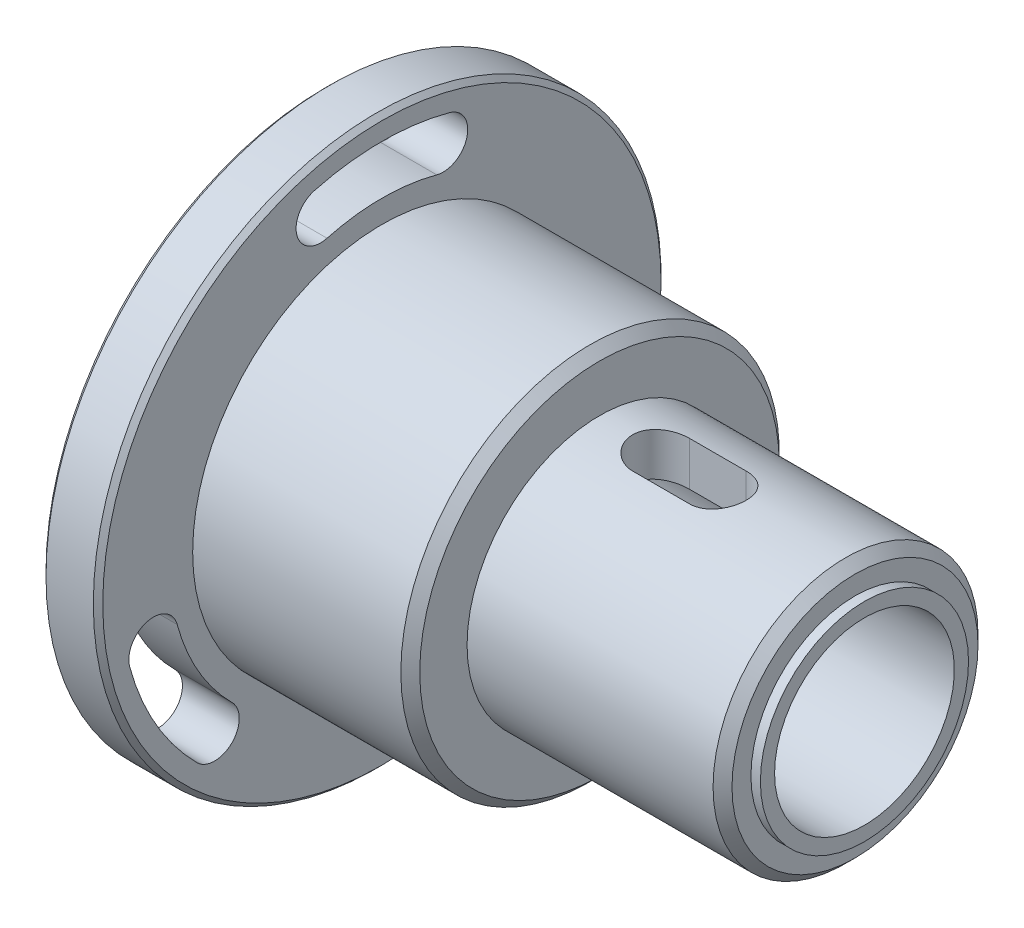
ISO-10303-21;
HEADER;
FILE_DESCRIPTION(('STEP AP214'),'2;1');
FILE_NAME('part.step','',(''),(''),'','','');
FILE_SCHEMA(('AUTOMOTIVE_DESIGN { 1 0 10303 214 1 1 1 1 }'));
ENDSEC;
DATA;
#1=APPLICATION_CONTEXT('core data for automotive mechanical design processes');
#2=APPLICATION_PROTOCOL_DEFINITION('international standard','automotive_design',2000,#1);
#3=PRODUCT_CONTEXT('',#1,'mechanical');
#4=PRODUCT('Part','Part','',(#3));
#5=PRODUCT_RELATED_PRODUCT_CATEGORY('part','',(#4));
#6=PRODUCT_DEFINITION_FORMATION('','',#4);
#7=PRODUCT_DEFINITION_CONTEXT('part definition',#1,'design');
#8=PRODUCT_DEFINITION('design','',#6,#7);
#9=PRODUCT_DEFINITION_SHAPE('','',#8);
#10=(LENGTH_UNIT() NAMED_UNIT(*) SI_UNIT(.MILLI.,.METRE.));
#11=(NAMED_UNIT(*) PLANE_ANGLE_UNIT() SI_UNIT($,.RADIAN.));
#12=(NAMED_UNIT(*) SI_UNIT($,.STERADIAN.) SOLID_ANGLE_UNIT());
#13=UNCERTAINTY_MEASURE_WITH_UNIT(LENGTH_MEASURE(1.E-05),#10,'distance_accuracy_value','');
#14=(GEOMETRIC_REPRESENTATION_CONTEXT(3) GLOBAL_UNCERTAINTY_ASSIGNED_CONTEXT((#13)) GLOBAL_UNIT_ASSIGNED_CONTEXT((#10,
#11,#12)) REPRESENTATION_CONTEXT('',''));
#15=CARTESIAN_POINT('',(0.,0.,0.));
#16=DIRECTION('',(0.,0.,1.));
#17=DIRECTION('',(1.,0.,0.));
#18=AXIS2_PLACEMENT_3D('',#15,#16,#17);
#19=CARTESIAN_POINT('',(0.,0.,0.));
#20=DIRECTION('',(-1.,0.,0.));
#21=DIRECTION('',(0.,0.,1.));
#22=AXIS2_PLACEMENT_3D('',#19,#20,#21);
#23=CYLINDRICAL_SURFACE('',#22,9.5);
#24=CARTESIAN_POINT('',(14.,0.,0.));
#25=DIRECTION('',(-1.,0.,0.));
#26=DIRECTION('',(0.,0.,1.));
#27=AXIS2_PLACEMENT_3D('',#24,#25,#26);
#28=CIRCLE('',#27,9.5);
#29=CARTESIAN_POINT('',(14.,0.,9.5));
#30=VERTEX_POINT('',#29);
#31=EDGE_CURVE('E352',#30,#30,#28,.T.);
#32=ORIENTED_EDGE('',*,*,#31,.T.);
#33=EDGE_LOOP('',(#32));
#34=FACE_BOUND('',#33,.T.);
#35=CARTESIAN_POINT('',(60.,0.,0.));
#36=DIRECTION('',(-1.,0.,0.));
#37=DIRECTION('',(0.,0.,1.));
#38=AXIS2_PLACEMENT_3D('',#35,#36,#37);
#39=CIRCLE('',#38,9.5);
#40=CARTESIAN_POINT('',(60.,0.,9.5));
#41=VERTEX_POINT('',#40);
#42=EDGE_CURVE('E349',#41,#41,#39,.T.);
#43=ORIENTED_EDGE('',*,*,#42,.F.);
#44=EDGE_LOOP('',(#43));
#45=FACE_BOUND('',#44,.T.);
#46=CARTESIAN_POINT('',(38.5,9.01387818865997,3.));
#47=CARTESIAN_POINT('',(38.4178884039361,9.0138659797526,3.00001051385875));
#48=CARTESIAN_POINT('',(38.3357837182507,9.01499989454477,2.99662905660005));
#49=CARTESIAN_POINT('',(38.1722056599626,9.01946917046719,2.98316404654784));
#50=CARTESIAN_POINT('',(38.0907321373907,9.02280399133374,2.97308213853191));
#51=CARTESIAN_POINT('',(37.9292133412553,9.03157240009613,2.94633448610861));
#52=CARTESIAN_POINT('',(37.8491647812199,9.03700024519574,2.92968675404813));
#53=CARTESIAN_POINT('',(37.6908532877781,9.04977799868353,2.88997412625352));
#54=CARTESIAN_POINT('',(37.612590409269,9.05712796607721,2.86690903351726));
#55=CARTESIAN_POINT('',(37.3813586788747,9.08173850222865,2.78838156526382));
#56=CARTESIAN_POINT('',(37.2317258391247,9.10157261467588,2.72354999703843));
#57=CARTESIAN_POINT('',(36.9454502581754,9.14584733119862,2.57094386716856));
#58=CARTESIAN_POINT('',(36.8088145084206,9.17029039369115,2.48315705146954));
#59=CARTESIAN_POINT('',(36.5475918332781,9.22198403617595,2.2838388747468));
#60=CARTESIAN_POINT('',(36.4235225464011,9.24929895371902,2.17164444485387));
#61=CARTESIAN_POINT('',(36.1956125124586,9.30311268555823,1.92811437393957));
#62=CARTESIAN_POINT('',(36.0917752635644,9.32961135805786,1.79677542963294));
#63=CARTESIAN_POINT('',(35.9049616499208,9.37954779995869,1.51492697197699));
#64=CARTESIAN_POINT('',(35.8225238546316,9.40290050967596,1.36404405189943));
#65=CARTESIAN_POINT('',(35.684403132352,9.44315613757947,1.049697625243));
#66=CARTESIAN_POINT('',(35.628712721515,9.46006085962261,0.88623765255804));
#67=CARTESIAN_POINT('',(35.5474069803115,9.48505937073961,0.55683120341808));
#68=CARTESIAN_POINT('',(35.5209003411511,9.49341369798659,0.391124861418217));
#69=CARTESIAN_POINT('',(35.4958889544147,9.50129109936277,0.0574168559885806));
#70=CARTESIAN_POINT('',(35.4973782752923,9.50081604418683,-0.110584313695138));
#71=CARTESIAN_POINT('',(35.5277344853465,9.49126851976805,-0.437828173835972));
#72=CARTESIAN_POINT('',(35.5556344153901,9.48249971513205,-0.597170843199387));
#73=CARTESIAN_POINT('',(35.6364309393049,9.45772480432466,-0.908782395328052));
#74=CARTESIAN_POINT('',(35.6893288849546,9.44171830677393,-1.06105089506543));
#75=CARTESIAN_POINT('',(35.819232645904,9.40386197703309,-1.35640803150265));
#76=CARTESIAN_POINT('',(35.8965292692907,9.38194214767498,-1.49935942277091));
#77=CARTESIAN_POINT('',(36.0728017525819,9.33456474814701,-1.77055948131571));
#78=CARTESIAN_POINT('',(36.1717829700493,9.309106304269,-1.89880450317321));
#79=CARTESIAN_POINT('',(36.3935531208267,9.25608223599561,-2.14270544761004));
#80=CARTESIAN_POINT('',(36.5171739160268,9.22847303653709,-2.25759649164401));
#81=CARTESIAN_POINT('',(36.7822127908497,9.17518254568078,-2.46526929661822));
#82=CARTESIAN_POINT('',(36.923636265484,9.14950184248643,-2.55804433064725));
#83=CARTESIAN_POINT('',(37.2224948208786,9.10274637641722,-2.71978065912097));
#84=CARTESIAN_POINT('',(37.3801034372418,9.08173131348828,-2.7884391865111));
#85=CARTESIAN_POINT('',(37.7053868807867,9.04739847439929,-2.89791755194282));
#86=CARTESIAN_POINT('',(37.8730456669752,9.0340687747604,-2.93878053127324));
#87=CARTESIAN_POINT('',(38.1185881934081,9.02162485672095,-2.97664323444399));
#88=CARTESIAN_POINT('',(38.1946296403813,9.01872707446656,-2.98539986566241));
#89=CARTESIAN_POINT('',(38.3471008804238,9.01485301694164,-2.99707362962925));
#90=CARTESIAN_POINT('',(38.4235299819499,9.01387406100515,-2.99999890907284));
#91=CARTESIAN_POINT('',(38.5,9.01387818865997,-3.));
#92=B_SPLINE_CURVE_WITH_KNOTS('',3,(#46,#47,#48,#49,#50,#51,#52,#53,#54,#55,#56,#57,#58,#59,#60,
#61,#62,#63,#64,#65,#66,#67,#68,#69,#70,#71,#72,#73,#74,#75,#76,#77,#78,#79,#80,#81,#82,#83,#84,
#85,#86,#87,#88,#89,#90,#91),.UNSPECIFIED.,.F.,.F.,(4,2,2,2,2,2,2,2,2,2,2,2,2,2,2,2,2,2,2,2,2,2,
4),(0.,0.24624563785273,0.492430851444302,0.737945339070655,0.983467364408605,1.47384684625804,
1.9644886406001,2.47064554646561,2.9768898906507,3.49485361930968,4.01267233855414,
4.5141953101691,5.01561202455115,5.49935290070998,5.98311993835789,6.47288577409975,
6.96277275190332,7.47344235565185,7.98426708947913,8.50129313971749,9.01751487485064,
9.24710313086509,9.47637041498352),.UNSPECIFIED.);
#93=CARTESIAN_POINT('',(38.5,9.01387818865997,3.));
#94=VERTEX_POINT('',#93);
#95=CARTESIAN_POINT('',(38.5,9.01387818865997,-3.));
#96=VERTEX_POINT('',#95);
#97=EDGE_CURVE('E322',#94,#96,#92,.T.);
#98=ORIENTED_EDGE('',*,*,#97,.F.);
#99=DIRECTION('',(-1.,0.,0.));
#100=VECTOR('',#99,1.);
#101=CARTESIAN_POINT('',(0.,9.01387818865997,3.));
#102=LINE('',#101,#100);
#103=CARTESIAN_POINT('',(44.5,9.01387818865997,3.));
#104=VERTEX_POINT('',#103);
#105=EDGE_CURVE('E266',#104,#94,#102,.T.);
#106=ORIENTED_EDGE('',*,*,#105,.F.);
#107=CARTESIAN_POINT('',(44.5,9.01387818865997,-3.));
#108=CARTESIAN_POINT('',(44.5821115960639,9.0138659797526,-3.00001051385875));
#109=CARTESIAN_POINT('',(44.6642162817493,9.01499989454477,-2.99662905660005));
#110=CARTESIAN_POINT('',(44.8277943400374,9.01946917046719,-2.98316404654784));
#111=CARTESIAN_POINT('',(44.9092678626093,9.02280399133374,-2.97308213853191));
#112=CARTESIAN_POINT('',(45.0707866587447,9.03157240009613,-2.94633448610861));
#113=CARTESIAN_POINT('',(45.1508352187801,9.03700024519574,-2.92968675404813));
#114=CARTESIAN_POINT('',(45.3091467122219,9.04977799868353,-2.88997412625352));
#115=CARTESIAN_POINT('',(45.387409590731,9.05712796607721,-2.86690903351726));
#116=CARTESIAN_POINT('',(45.6186413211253,9.08173850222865,-2.78838156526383));
#117=CARTESIAN_POINT('',(45.7682741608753,9.10157261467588,-2.72354999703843));
#118=CARTESIAN_POINT('',(46.0545497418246,9.14584733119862,-2.57094386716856));
#119=CARTESIAN_POINT('',(46.1911854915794,9.17029039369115,-2.48315705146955));
#120=CARTESIAN_POINT('',(46.4524081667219,9.22198403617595,-2.2838388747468));
#121=CARTESIAN_POINT('',(46.5764774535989,9.24929895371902,-2.17164444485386));
#122=CARTESIAN_POINT('',(46.8043874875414,9.30311268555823,-1.92811437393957));
#123=CARTESIAN_POINT('',(46.9082247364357,9.32961135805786,-1.79677542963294));
#124=CARTESIAN_POINT('',(47.0950383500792,9.3795477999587,-1.51492697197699));
#125=CARTESIAN_POINT('',(47.1774761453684,9.40290050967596,-1.36404405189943));
#126=CARTESIAN_POINT('',(47.315596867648,9.44315613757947,-1.049697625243));
#127=CARTESIAN_POINT('',(47.371287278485,9.46006085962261,-0.886237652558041));
#128=CARTESIAN_POINT('',(47.4525930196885,9.48505937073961,-0.556831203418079));
#129=CARTESIAN_POINT('',(47.4790996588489,9.49341369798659,-0.391124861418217));
#130=CARTESIAN_POINT('',(47.5041110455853,9.50129109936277,-0.0574168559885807));
#131=CARTESIAN_POINT('',(47.5026217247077,9.50081604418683,0.110584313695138));
#132=CARTESIAN_POINT('',(47.4722655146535,9.49126851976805,0.437828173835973));
#133=CARTESIAN_POINT('',(47.4443655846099,9.48249971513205,0.597170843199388));
#134=CARTESIAN_POINT('',(47.3635690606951,9.45772480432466,0.908782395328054));
#135=CARTESIAN_POINT('',(47.3106711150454,9.44171830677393,1.06105089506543));
#136=CARTESIAN_POINT('',(47.180767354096,9.40386197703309,1.35640803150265));
#137=CARTESIAN_POINT('',(47.1034707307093,9.38194214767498,1.4993594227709));
#138=CARTESIAN_POINT('',(46.9271982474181,9.33456474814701,1.77055948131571));
#139=CARTESIAN_POINT('',(46.8282170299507,9.309106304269,1.89880450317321));
#140=CARTESIAN_POINT('',(46.6064468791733,9.25608223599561,2.14270544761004));
#141=CARTESIAN_POINT('',(46.4828260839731,9.22847303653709,2.25759649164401));
#142=CARTESIAN_POINT('',(46.2177872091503,9.17518254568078,2.46526929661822));
#143=CARTESIAN_POINT('',(46.076363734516,9.14950184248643,2.55804433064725));
#144=CARTESIAN_POINT('',(45.7775051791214,9.10274637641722,2.71978065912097));
#145=CARTESIAN_POINT('',(45.6198965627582,9.08173131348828,2.7884391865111));
#146=CARTESIAN_POINT('',(45.2946131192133,9.04739847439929,2.89791755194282));
#147=CARTESIAN_POINT('',(45.1269543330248,9.0340687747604,2.93878053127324));
#148=CARTESIAN_POINT('',(44.8814118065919,9.02162485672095,2.97664323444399));
#149=CARTESIAN_POINT('',(44.8053703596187,9.01872707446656,2.98539986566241));
#150=CARTESIAN_POINT('',(44.6528991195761,9.01485301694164,2.99707362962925));
#151=CARTESIAN_POINT('',(44.5764700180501,9.01387406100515,2.99999890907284));
#152=CARTESIAN_POINT('',(44.5,9.01387818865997,3.));
#153=B_SPLINE_CURVE_WITH_KNOTS('',3,(#107,#108,#109,#110,#111,#112,#113,#114,#115,#116,#117,
#118,#119,#120,#121,#122,#123,#124,#125,#126,#127,#128,#129,#130,#131,#132,#133,#134,#135,#136,
#137,#138,#139,#140,#141,#142,#143,#144,#145,#146,#147,#148,#149,#150,#151,#152),.UNSPECIFIED.,
.F.,.F.,(4,2,2,2,2,2,2,2,2,2,2,2,2,2,2,2,2,2,2,2,2,2,4),(0.,0.24624563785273,0.492430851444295,
0.737945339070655,0.983467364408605,1.47384684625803,1.9644886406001,2.47064554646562,
2.9768898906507,3.49485361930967,4.01267233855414,4.5141953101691,5.01561202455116,
5.49935290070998,5.98311993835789,6.47288577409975,6.96277275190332,7.47344235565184,
7.98426708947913,8.50129313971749,9.01751487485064,9.24710313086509,9.47637041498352),.UNSPECIFIED.);
#154=CARTESIAN_POINT('',(44.5,9.01387818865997,-3.));
#155=VERTEX_POINT('',#154);
#156=EDGE_CURVE('E259',#155,#104,#153,.T.);
#157=ORIENTED_EDGE('',*,*,#156,.F.);
#158=DIRECTION('',(-1.,0.,0.));
#159=VECTOR('',#158,1.);
#160=CARTESIAN_POINT('',(0.,9.01387818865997,-3.));
#161=LINE('',#160,#159);
#162=EDGE_CURVE('E257',#96,#155,#161,.F.);
#163=ORIENTED_EDGE('',*,*,#162,.F.);
#164=EDGE_LOOP('',(#98,#106,#157,#163));
#165=FACE_BOUND('',#164,.T.);
#166=ADVANCED_FACE('F32',(#34,#45,#165),#23,.F.);
#167=CARTESIAN_POINT('',(0.,0.,0.));
#168=DIRECTION('',(-1.,0.,0.));
#169=DIRECTION('',(0.,0.,1.));
#170=AXIS2_PLACEMENT_3D('',#167,#168,#169);
#171=CYLINDRICAL_SURFACE('',#170,14.);
#172=CARTESIAN_POINT('',(58.,0.,0.));
#173=DIRECTION('',(-1.,0.,0.));
#174=DIRECTION('',(0.,0.,1.));
#175=AXIS2_PLACEMENT_3D('',#172,#173,#174);
#176=CIRCLE('',#175,14.);
#177=CARTESIAN_POINT('',(58.,0.,14.));
#178=VERTEX_POINT('',#177);
#179=EDGE_CURVE('E312',#178,#178,#176,.T.);
#180=ORIENTED_EDGE('',*,*,#179,.T.);
#181=EDGE_LOOP('',(#180));
#182=FACE_BOUND('',#181,.T.);
#183=CARTESIAN_POINT('',(32.,0.,0.));
#184=DIRECTION('',(-1.,0.,0.));
#185=DIRECTION('',(0.,0.,1.));
#186=AXIS2_PLACEMENT_3D('',#183,#184,#185);
#187=CIRCLE('',#186,14.);
#188=CARTESIAN_POINT('',(32.,0.,14.));
#189=VERTEX_POINT('',#188);
#190=EDGE_CURVE('E340',#189,#189,#187,.T.);
#191=ORIENTED_EDGE('',*,*,#190,.F.);
#192=EDGE_LOOP('',(#191));
#193=FACE_BOUND('',#192,.T.);
#194=CARTESIAN_POINT('',(38.5,13.6747943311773,-3.));
#195=CARTESIAN_POINT('',(38.4166573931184,13.6747865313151,-3.00000920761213));
#196=CARTESIAN_POINT('',(38.3333199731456,13.6755560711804,-2.99652711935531));
#197=CARTESIAN_POINT('',(38.1672608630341,13.6785920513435,-2.98265179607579));
#198=CARTESIAN_POINT('',(38.0845390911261,13.68085828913,-2.97225949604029));
#199=CARTESIAN_POINT('',(37.9204284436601,13.6868250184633,-2.94465781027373));
#200=CARTESIAN_POINT('',(37.8390376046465,13.6905231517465,-2.92745963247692));
#201=CARTESIAN_POINT('',(37.678049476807,13.6992382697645,-2.88640046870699));
#202=CARTESIAN_POINT('',(37.5984521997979,13.7042552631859,-2.86253943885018));
#203=CARTESIAN_POINT('',(37.3631762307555,13.7210788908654,-2.78120552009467));
#204=CARTESIAN_POINT('',(37.2108743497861,13.7346635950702,-2.71395822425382));
#205=CARTESIAN_POINT('',(36.9197688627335,13.7650311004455,-2.55546220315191));
#206=CARTESIAN_POINT('',(36.7809672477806,13.78181437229,-2.46420994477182));
#207=CARTESIAN_POINT('',(36.5184862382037,13.816990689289,-2.25870871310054));
#208=CARTESIAN_POINT('',(36.3950539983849,13.8354034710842,-2.14414685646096));
#209=CARTESIAN_POINT('',(36.1689993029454,13.8715924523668,-1.89594929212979));
#210=CARTESIAN_POINT('',(36.0663800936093,13.889368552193,-1.76231061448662));
#211=CARTESIAN_POINT('',(35.8838871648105,13.9224958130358,-1.47809089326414));
#212=CARTESIAN_POINT('',(35.8042525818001,13.9378207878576,-1.32735297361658));
#213=CARTESIAN_POINT('',(35.6715416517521,13.9640940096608,-1.01425985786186));
#214=CARTESIAN_POINT('',(35.6184610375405,13.9750429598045,-0.851906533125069));
#215=CARTESIAN_POINT('',(35.5411405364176,13.9911912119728,-0.522776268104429));
#216=CARTESIAN_POINT('',(35.5164787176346,13.9964745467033,-0.35610264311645));
#217=CARTESIAN_POINT('',(35.4953773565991,14.0009872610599,-0.0209017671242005));
#218=CARTESIAN_POINT('',(35.4989353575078,14.000217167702,0.147625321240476));
#219=CARTESIAN_POINT('',(35.5338579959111,13.9927740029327,0.478834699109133));
#220=CARTESIAN_POINT('',(35.5647672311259,13.986197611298,0.641567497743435));
#221=CARTESIAN_POINT('',(35.652789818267,13.9679907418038,0.959480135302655));
#222=CARTESIAN_POINT('',(35.7099041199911,13.956360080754,1.11465970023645));
#223=CARTESIAN_POINT('',(35.8491239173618,13.9291948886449,1.41433723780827));
#224=CARTESIAN_POINT('',(35.9314038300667,13.9136332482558,1.55875162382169));
#225=CARTESIAN_POINT('',(36.1184872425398,13.8803153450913,1.83188572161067));
#226=CARTESIAN_POINT('',(36.2232930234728,13.8625588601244,1.9606038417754));
#227=CARTESIAN_POINT('',(36.4549218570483,13.8263888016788,2.20138896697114));
#228=CARTESIAN_POINT('',(36.5821409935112,13.8079691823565,2.31307431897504));
#229=CARTESIAN_POINT('',(36.853732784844,13.7728755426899,2.51362271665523));
#230=CARTESIAN_POINT('',(36.9981101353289,13.7562020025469,2.60247949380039));
#231=CARTESIAN_POINT('',(37.300542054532,13.7264703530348,2.75501249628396));
#232=CARTESIAN_POINT('',(37.4586401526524,13.7134243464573,2.81860472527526));
#233=CARTESIAN_POINT('',(37.7835236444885,13.6925966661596,2.91812013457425));
#234=CARTESIAN_POINT('',(37.9502957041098,13.6848071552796,2.95408451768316));
#235=CARTESIAN_POINT('',(38.1820264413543,13.6783426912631,2.98378658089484));
#236=CARTESIAN_POINT('',(38.2455165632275,13.677013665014,2.98986846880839));
#237=CARTESIAN_POINT('',(38.3726614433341,13.6752401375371,2.99797020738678));
#238=CARTESIAN_POINT('',(38.4363157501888,13.6747941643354,2.99999681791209));
#239=CARTESIAN_POINT('',(38.5,13.6747943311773,3.));
#240=B_SPLINE_CURVE_WITH_KNOTS('',3,(#194,#195,#196,#197,#198,#199,#200,#201,#202,#203,#204,
#205,#206,#207,#208,#209,#210,#211,#212,#213,#214,#215,#216,#217,#218,#219,#220,#221,#222,#223,
#224,#225,#226,#227,#228,#229,#230,#231,#232,#233,#234,#235,#236,#237,#238,#239),.UNSPECIFIED.,
.F.,.F.,(4,2,2,2,2,2,2,2,2,2,2,2,2,2,2,2,2,2,2,2,2,2,4),(0.,0.249942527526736,0.499851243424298,
0.74935011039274,0.998850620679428,1.4974335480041,1.99608989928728,2.50194288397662,
3.00787470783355,3.51889480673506,4.02983275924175,4.53308293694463,5.03628930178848,
5.5312716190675,6.02627187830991,6.52478374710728,7.02334612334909,7.5318143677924,
8.04042208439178,8.55070688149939,9.06022917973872,9.25150759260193,9.44246689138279),.UNSPECIFIED.);
#241=CARTESIAN_POINT('',(38.5,13.6747943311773,-3.));
#242=VERTEX_POINT('',#241);
#243=CARTESIAN_POINT('',(38.5,13.6747943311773,3.));
#244=VERTEX_POINT('',#243);
#245=EDGE_CURVE('E307',#242,#244,#240,.T.);
#246=ORIENTED_EDGE('',*,*,#245,.F.);
#247=DIRECTION('',(-1.,0.,0.));
#248=VECTOR('',#247,1.);
#249=CARTESIAN_POINT('',(0.,13.6747943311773,-3.));
#250=LINE('',#249,#248);
#251=CARTESIAN_POINT('',(44.5,13.6747943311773,-3.));
#252=VERTEX_POINT('',#251);
#253=EDGE_CURVE('E292',#252,#242,#250,.T.);
#254=ORIENTED_EDGE('',*,*,#253,.F.);
#255=CARTESIAN_POINT('',(44.5,13.6747943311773,3.));
#256=CARTESIAN_POINT('',(44.5833426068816,13.6747865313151,3.00000920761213));
#257=CARTESIAN_POINT('',(44.6666800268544,13.6755560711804,2.99652711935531));
#258=CARTESIAN_POINT('',(44.8327391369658,13.6785920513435,2.98265179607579));
#259=CARTESIAN_POINT('',(44.9154609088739,13.68085828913,2.97225949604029));
#260=CARTESIAN_POINT('',(45.0795715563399,13.6868250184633,2.94465781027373));
#261=CARTESIAN_POINT('',(45.1609623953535,13.6905231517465,2.92745963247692));
#262=CARTESIAN_POINT('',(45.321950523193,13.6992382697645,2.88640046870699));
#263=CARTESIAN_POINT('',(45.4015478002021,13.7042552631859,2.86253943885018));
#264=CARTESIAN_POINT('',(45.6368237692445,13.7210788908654,2.78120552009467));
#265=CARTESIAN_POINT('',(45.7891256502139,13.7346635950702,2.71395822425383));
#266=CARTESIAN_POINT('',(46.0802311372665,13.7650311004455,2.55546220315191));
#267=CARTESIAN_POINT('',(46.2190327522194,13.78181437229,2.46420994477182));
#268=CARTESIAN_POINT('',(46.4815137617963,13.816990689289,2.25870871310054));
#269=CARTESIAN_POINT('',(46.6049460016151,13.8354034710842,2.14414685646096));
#270=CARTESIAN_POINT('',(46.8310006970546,13.8715924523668,1.8959492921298));
#271=CARTESIAN_POINT('',(46.9336199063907,13.889368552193,1.76231061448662));
#272=CARTESIAN_POINT('',(47.1161128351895,13.9224958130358,1.47809089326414));
#273=CARTESIAN_POINT('',(47.1957474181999,13.9378207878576,1.32735297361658));
#274=CARTESIAN_POINT('',(47.3284583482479,13.9640940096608,1.01425985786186));
#275=CARTESIAN_POINT('',(47.3815389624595,13.9750429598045,0.851906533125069));
#276=CARTESIAN_POINT('',(47.4588594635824,13.9911912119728,0.522776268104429));
#277=CARTESIAN_POINT('',(47.4835212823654,13.9964745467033,0.35610264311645));
#278=CARTESIAN_POINT('',(47.5046226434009,14.0009872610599,0.0209017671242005));
#279=CARTESIAN_POINT('',(47.5010646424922,14.000217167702,-0.147625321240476));
#280=CARTESIAN_POINT('',(47.4661420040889,13.9927740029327,-0.478834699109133));
#281=CARTESIAN_POINT('',(47.4352327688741,13.986197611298,-0.641567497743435));
#282=CARTESIAN_POINT('',(47.347210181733,13.9679907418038,-0.959480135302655));
#283=CARTESIAN_POINT('',(47.2900958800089,13.956360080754,-1.11465970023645));
#284=CARTESIAN_POINT('',(47.1508760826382,13.9291948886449,-1.41433723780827));
#285=CARTESIAN_POINT('',(47.0685961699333,13.9136332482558,-1.55875162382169));
#286=CARTESIAN_POINT('',(46.8815127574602,13.8803153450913,-1.83188572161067));
#287=CARTESIAN_POINT('',(46.7767069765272,13.8625588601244,-1.9606038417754));
#288=CARTESIAN_POINT('',(46.5450781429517,13.8263888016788,-2.20138896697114));
#289=CARTESIAN_POINT('',(46.4178590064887,13.8079691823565,-2.31307431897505));
#290=CARTESIAN_POINT('',(46.146267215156,13.7728755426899,-2.51362271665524));
#291=CARTESIAN_POINT('',(46.0018898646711,13.7562020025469,-2.60247949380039));
#292=CARTESIAN_POINT('',(45.699457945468,13.7264703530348,-2.75501249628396));
#293=CARTESIAN_POINT('',(45.5413598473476,13.7134243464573,-2.81860472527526));
#294=CARTESIAN_POINT('',(45.2164763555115,13.6925966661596,-2.91812013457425));
#295=CARTESIAN_POINT('',(45.0497042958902,13.6848071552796,-2.95408451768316));
#296=CARTESIAN_POINT('',(44.8179735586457,13.6783426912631,-2.98378658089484));
#297=CARTESIAN_POINT('',(44.7544834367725,13.677013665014,-2.98986846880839));
#298=CARTESIAN_POINT('',(44.6273385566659,13.6752401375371,-2.99797020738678));
#299=CARTESIAN_POINT('',(44.5636842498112,13.6747941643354,-2.99999681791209));
#300=CARTESIAN_POINT('',(44.5,13.6747943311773,-3.));
#301=B_SPLINE_CURVE_WITH_KNOTS('',3,(#255,#256,#257,#258,#259,#260,#261,#262,#263,#264,#265,
#266,#267,#268,#269,#270,#271,#272,#273,#274,#275,#276,#277,#278,#279,#280,#281,#282,#283,#284,
#285,#286,#287,#288,#289,#290,#291,#292,#293,#294,#295,#296,#297,#298,#299,#300),.UNSPECIFIED.,
.F.,.F.,(4,2,2,2,2,2,2,2,2,2,2,2,2,2,2,2,2,2,2,2,2,2,4),(0.,0.249942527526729,0.499851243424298,
0.749350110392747,0.998850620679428,1.49743354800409,1.99608989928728,2.50194288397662,
3.00787470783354,3.51889480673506,4.02983275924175,4.53308293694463,5.03628930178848,
5.5312716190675,6.02627187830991,6.52478374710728,7.02334612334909,7.5318143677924,
8.04042208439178,8.55070688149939,9.06022917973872,9.25150759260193,9.44246689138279),.UNSPECIFIED.);
#302=CARTESIAN_POINT('',(44.5,13.6747943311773,3.));
#303=VERTEX_POINT('',#302);
#304=EDGE_CURVE('E283',#303,#252,#301,.T.);
#305=ORIENTED_EDGE('',*,*,#304,.F.);
#306=DIRECTION('',(-1.,0.,0.));
#307=VECTOR('',#306,1.);
#308=CARTESIAN_POINT('',(0.,13.6747943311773,3.));
#309=LINE('',#308,#307);
#310=EDGE_CURVE('E291',#244,#303,#309,.F.);
#311=ORIENTED_EDGE('',*,*,#310,.F.);
#312=EDGE_LOOP('',(#246,#254,#305,#311));
#313=FACE_BOUND('',#312,.T.);
#314=ADVANCED_FACE('F295',(#182,#193,#313),#171,.T.);
#315=CARTESIAN_POINT('',(15.,14.,0.));
#316=DIRECTION('',(1.,0.,0.));
#317=DIRECTION('',(0.,0.,-1.));
#318=AXIS2_PLACEMENT_3D('',#315,#316,#317);
#319=PLANE('',#318);
#320=CARTESIAN_POINT('',(15.,0.,0.));
#321=DIRECTION('',(-1.,0.,0.));
#322=DIRECTION('',(0.,0.,1.));
#323=AXIS2_PLACEMENT_3D('',#320,#321,#322);
#324=CIRCLE('',#323,11.);
#325=CARTESIAN_POINT('',(15.,0.,11.));
#326=VERTEX_POINT('',#325);
#327=EDGE_CURVE('E357',#326,#326,#324,.T.);
#328=ORIENTED_EDGE('',*,*,#327,.F.);
#329=EDGE_LOOP('',(#328));
#330=FACE_BOUND('',#329,.T.);
#331=CARTESIAN_POINT('',(15.,0.,0.));
#332=DIRECTION('',(-1.,0.,0.));
#333=DIRECTION('',(0.,0.,1.));
#334=AXIS2_PLACEMENT_3D('',#331,#332,#333);
#335=CIRCLE('',#334,14.);
#336=CARTESIAN_POINT('',(15.,0.,14.));
#337=VERTEX_POINT('',#336);
#338=EDGE_CURVE('E328',#337,#337,#335,.T.);
#339=ORIENTED_EDGE('',*,*,#338,.T.);
#340=EDGE_LOOP('',(#339));
#341=FACE_BOUND('',#340,.T.);
#342=ADVANCED_FACE('F300',(#330,#341),#319,.F.);
#343=CARTESIAN_POINT('',(0.,0.,0.));
#344=DIRECTION('',(-1.,0.,0.));
#345=DIRECTION('',(0.,0.,1.));
#346=AXIS2_PLACEMENT_3D('',#343,#344,#345);
#347=CYLINDRICAL_SURFACE('',#346,11.);
#348=CARTESIAN_POINT('',(14.,0.,0.));
#349=DIRECTION('',(-1.,0.,0.));
#350=DIRECTION('',(0.,0.,1.));
#351=AXIS2_PLACEMENT_3D('',#348,#349,#350);
#352=CIRCLE('',#351,11.);
#353=CARTESIAN_POINT('',(14.,0.,11.));
#354=VERTEX_POINT('',#353);
#355=EDGE_CURVE('E355',#354,#354,#352,.T.);
#356=ORIENTED_EDGE('',*,*,#355,.F.);
#357=EDGE_LOOP('',(#356));
#358=FACE_BOUND('',#357,.T.);
#359=ORIENTED_EDGE('',*,*,#327,.T.);
#360=EDGE_LOOP('',(#359));
#361=FACE_BOUND('',#360,.T.);
#362=ADVANCED_FACE('F394',(#358,#361),#347,.T.);
#363=CARTESIAN_POINT('',(14.,11.,0.));
#364=DIRECTION('',(1.,0.,0.));
#365=DIRECTION('',(0.,0.,-1.));
#366=AXIS2_PLACEMENT_3D('',#363,#364,#365);
#367=PLANE('',#366);
#368=ORIENTED_EDGE('',*,*,#31,.F.);
#369=EDGE_LOOP('',(#368));
#370=FACE_BOUND('',#369,.T.);
#371=ORIENTED_EDGE('',*,*,#355,.T.);
#372=EDGE_LOOP('',(#371));
#373=FACE_BOUND('',#372,.T.);
#374=ADVANCED_FACE('F387',(#370,#373),#367,.F.);
#375=CARTESIAN_POINT('',(60.,9.5,0.));
#376=DIRECTION('',(-1.,0.,0.));
#377=DIRECTION('',(0.,0.,1.));
#378=AXIS2_PLACEMENT_3D('',#375,#376,#377);
#379=PLANE('',#378);
#380=CARTESIAN_POINT('',(60.,0.,0.));
#381=DIRECTION('',(-1.,0.,0.));
#382=DIRECTION('',(0.,0.,1.));
#383=AXIS2_PLACEMENT_3D('',#380,#381,#382);
#384=CIRCLE('',#383,11.);
#385=CARTESIAN_POINT('',(60.,0.,11.));
#386=VERTEX_POINT('',#385);
#387=EDGE_CURVE('E346',#386,#386,#384,.T.);
#388=ORIENTED_EDGE('',*,*,#387,.F.);
#389=EDGE_LOOP('',(#388));
#390=FACE_BOUND('',#389,.T.);
#391=ORIENTED_EDGE('',*,*,#42,.T.);
#392=EDGE_LOOP('',(#391));
#393=FACE_BOUND('',#392,.T.);
#394=ADVANCED_FACE('F384',(#390,#393),#379,.F.);
#395=CARTESIAN_POINT('',(0.,0.,0.));
#396=DIRECTION('',(-1.,0.,0.));
#397=DIRECTION('',(0.,0.,1.));
#398=AXIS2_PLACEMENT_3D('',#395,#396,#397);
#399=CYLINDRICAL_SURFACE('',#398,11.);
#400=CARTESIAN_POINT('',(59.,0.,0.));
#401=DIRECTION('',(-1.,0.,0.));
#402=DIRECTION('',(0.,0.,1.));
#403=AXIS2_PLACEMENT_3D('',#400,#401,#402);
#404=CIRCLE('',#403,11.);
#405=CARTESIAN_POINT('',(59.,0.,11.));
#406=VERTEX_POINT('',#405);
#407=EDGE_CURVE('E343',#406,#406,#404,.T.);
#408=ORIENTED_EDGE('',*,*,#407,.F.);
#409=EDGE_LOOP('',(#408));
#410=FACE_BOUND('',#409,.T.);
#411=ORIENTED_EDGE('',*,*,#387,.T.);
#412=EDGE_LOOP('',(#411));
#413=FACE_BOUND('',#412,.T.);
#414=ADVANCED_FACE('F386',(#410,#413),#399,.T.);
#415=CARTESIAN_POINT('',(59.,11.,0.));
#416=DIRECTION('',(-1.,0.,0.));
#417=DIRECTION('',(0.,0.,1.));
#418=AXIS2_PLACEMENT_3D('',#415,#416,#417);
#419=PLANE('',#418);
#420=CARTESIAN_POINT('',(59.,0.,0.));
#421=DIRECTION('',(-1.,0.,0.));
#422=DIRECTION('',(0.,0.,1.));
#423=AXIS2_PLACEMENT_3D('',#420,#421,#422);
#424=CIRCLE('',#423,13.);
#425=CARTESIAN_POINT('',(59.,0.,13.));
#426=VERTEX_POINT('',#425);
#427=EDGE_CURVE('E449',#426,#426,#424,.F.);
#428=ORIENTED_EDGE('',*,*,#427,.T.);
#429=EDGE_LOOP('',(#428));
#430=FACE_BOUND('',#429,.T.);
#431=ORIENTED_EDGE('',*,*,#407,.T.);
#432=EDGE_LOOP('',(#431));
#433=FACE_BOUND('',#432,.T.);
#434=ADVANCED_FACE('F304',(#430,#433),#419,.F.);
#435=CARTESIAN_POINT('',(32.,14.,0.));
#436=DIRECTION('',(-1.,0.,0.));
#437=DIRECTION('',(0.,0.,1.));
#438=AXIS2_PLACEMENT_3D('',#435,#436,#437);
#439=PLANE('',#438);
#440=CARTESIAN_POINT('',(32.,0.,0.));
#441=DIRECTION('',(-1.,0.,0.));
#442=DIRECTION('',(0.,0.,1.));
#443=AXIS2_PLACEMENT_3D('',#440,#441,#442);
#444=CIRCLE('',#443,19.);
#445=CARTESIAN_POINT('',(32.,0.,19.));
#446=VERTEX_POINT('',#445);
#447=EDGE_CURVE('E444',#446,#446,#444,.F.);
#448=ORIENTED_EDGE('',*,*,#447,.T.);
#449=EDGE_LOOP('',(#448));
#450=FACE_BOUND('',#449,.T.);
#451=ORIENTED_EDGE('',*,*,#190,.T.);
#452=EDGE_LOOP('',(#451));
#453=FACE_BOUND('',#452,.T.);
#454=ADVANCED_FACE('F302',(#450,#453),#439,.F.);
#455=CARTESIAN_POINT('',(0.,0.,0.));
#456=DIRECTION('',(-1.,0.,0.));
#457=DIRECTION('',(0.,0.,1.));
#458=AXIS2_PLACEMENT_3D('',#455,#456,#457);
#459=CYLINDRICAL_SURFACE('',#458,20.);
#460=CARTESIAN_POINT('',(31.,0.,0.));
#461=DIRECTION('',(-1.,0.,0.));
#462=DIRECTION('',(0.,0.,1.));
#463=AXIS2_PLACEMENT_3D('',#460,#461,#462);
#464=CIRCLE('',#463,20.);
#465=CARTESIAN_POINT('',(31.,0.,20.));
#466=VERTEX_POINT('',#465);
#467=EDGE_CURVE('E447',#466,#466,#464,.T.);
#468=ORIENTED_EDGE('',*,*,#467,.T.);
#469=EDGE_LOOP('',(#468));
#470=FACE_BOUND('',#469,.T.);
#471=CARTESIAN_POINT('',(9.,0.,0.));
#472=DIRECTION('',(-1.,0.,0.));
#473=DIRECTION('',(0.,0.,1.));
#474=AXIS2_PLACEMENT_3D('',#471,#472,#473);
#475=CIRCLE('',#474,20.);
#476=CARTESIAN_POINT('',(9.,0.,20.));
#477=VERTEX_POINT('',#476);
#478=EDGE_CURVE('E337',#477,#477,#475,.T.);
#479=ORIENTED_EDGE('',*,*,#478,.F.);
#480=EDGE_LOOP('',(#479));
#481=FACE_BOUND('',#480,.T.);
#482=ADVANCED_FACE('F460',(#470,#481),#459,.T.);
#483=CARTESIAN_POINT('',(9.,20.,0.));
#484=DIRECTION('',(-1.,0.,0.));
#485=DIRECTION('',(0.,0.,1.));
#486=AXIS2_PLACEMENT_3D('',#483,#484,#485);
#487=PLANE('',#486);
#488=CARTESIAN_POINT('',(9.,0.,0.));
#489=DIRECTION('',(-1.,0.,0.));
#490=DIRECTION('',(0.,0.,1.));
#491=AXIS2_PLACEMENT_3D('',#488,#489,#490);
#492=CIRCLE('',#491,29.5);
#493=CARTESIAN_POINT('',(9.,0.,29.5));
#494=VERTEX_POINT('',#493);
#495=EDGE_CURVE('E434',#494,#494,#492,.F.);
#496=ORIENTED_EDGE('',*,*,#495,.T.);
#497=EDGE_LOOP('',(#496));
#498=FACE_BOUND('',#497,.T.);
#499=CARTESIAN_POINT('',(9.,0.,0.));
#500=DIRECTION('',(-1.,0.,0.));
#501=DIRECTION('',(0.,0.,1.));
#502=AXIS2_PLACEMENT_3D('',#499,#500,#501);
#503=CIRCLE('',#502,27.6);
#504=CARTESIAN_POINT('',(9.00000000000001,-19.5161471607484,19.516147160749));
#505=VERTEX_POINT('',#504);
#506=CARTESIAN_POINT('',(9.00000000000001,-7.14340564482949,26.6595528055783));
#507=VERTEX_POINT('',#506);
#508=EDGE_CURVE('E176',#505,#507,#503,.T.);
#509=ORIENTED_EDGE('',*,*,#508,.T.);
#510=CARTESIAN_POINT('',(9.,-6.47047612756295,24.1481456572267));
#511=DIRECTION('',(-1.,0.,0.));
#512=DIRECTION('',(0.,0.,1.));
#513=AXIS2_PLACEMENT_3D('',#510,#511,#512);
#514=CIRCLE('',#513,2.6);
#515=CARTESIAN_POINT('',(9.00000000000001,-5.7975466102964,21.6367385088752));
#516=VERTEX_POINT('',#515);
#517=EDGE_CURVE('E179',#507,#516,#514,.T.);
#518=ORIENTED_EDGE('',*,*,#517,.T.);
#519=CARTESIAN_POINT('',(9.,0.,0.));
#520=DIRECTION('',(-1.,0.,0.));
#521=DIRECTION('',(0.,0.,1.));
#522=AXIS2_PLACEMENT_3D('',#519,#520,#521);
#523=CIRCLE('',#522,22.4);
#524=CARTESIAN_POINT('',(9.,-15.8391918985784,15.8391918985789));
#525=VERTEX_POINT('',#524);
#526=EDGE_CURVE('E171',#516,#525,#523,.F.);
#527=ORIENTED_EDGE('',*,*,#526,.T.);
#528=CARTESIAN_POINT('',(9.,-17.6776695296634,17.677669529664));
#529=DIRECTION('',(-1.,0.,0.));
#530=DIRECTION('',(0.,0.,1.));
#531=AXIS2_PLACEMENT_3D('',#528,#529,#530);
#532=CIRCLE('',#531,2.6);
#533=EDGE_CURVE('E151',#525,#505,#532,.T.);
#534=ORIENTED_EDGE('',*,*,#533,.T.);
#535=EDGE_LOOP('',(#509,#518,#527,#534));
#536=FACE_BOUND('',#535,.T.);
#537=CARTESIAN_POINT('',(9.,0.,0.));
#538=DIRECTION('',(-1.,0.,0.));
#539=DIRECTION('',(0.,0.,1.));
#540=AXIS2_PLACEMENT_3D('',#537,#538,#539);
#541=CIRCLE('',#540,27.6);
#542=CARTESIAN_POINT('',(9.00000000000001,-7.14340564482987,-26.6595528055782));
#543=VERTEX_POINT('',#542);
#544=CARTESIAN_POINT('',(9.00000000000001,-19.5161471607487,-19.5161471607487));
#545=VERTEX_POINT('',#544);
#546=EDGE_CURVE('E208',#543,#545,#541,.T.);
#547=ORIENTED_EDGE('',*,*,#546,.T.);
#548=CARTESIAN_POINT('',(9.,-17.6776695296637,-17.6776695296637));
#549=DIRECTION('',(-1.,0.,0.));
#550=DIRECTION('',(0.,0.,1.));
#551=AXIS2_PLACEMENT_3D('',#548,#549,#550);
#552=CIRCLE('',#551,2.6);
#553=CARTESIAN_POINT('',(9.00000000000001,-15.8391918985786,-15.8391918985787));
#554=VERTEX_POINT('',#553);
#555=EDGE_CURVE('E211',#545,#554,#552,.T.);
#556=ORIENTED_EDGE('',*,*,#555,.T.);
#557=CARTESIAN_POINT('',(9.,0.,0.));
#558=DIRECTION('',(-1.,0.,0.));
#559=DIRECTION('',(0.,0.,1.));
#560=AXIS2_PLACEMENT_3D('',#557,#558,#559);
#561=CIRCLE('',#560,22.4);
#562=CARTESIAN_POINT('',(9.,-5.7975466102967,-21.6367385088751));
#563=VERTEX_POINT('',#562);
#564=EDGE_CURVE('E196',#554,#563,#561,.F.);
#565=ORIENTED_EDGE('',*,*,#564,.T.);
#566=CARTESIAN_POINT('',(9.,-6.47047612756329,-24.1481456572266));
#567=DIRECTION('',(-1.,0.,0.));
#568=DIRECTION('',(0.,0.,1.));
#569=AXIS2_PLACEMENT_3D('',#566,#567,#568);
#570=CIRCLE('',#569,2.6);
#571=EDGE_CURVE('E205',#563,#543,#570,.T.);
#572=ORIENTED_EDGE('',*,*,#571,.T.);
#573=EDGE_LOOP('',(#547,#556,#565,#572));
#574=FACE_BOUND('',#573,.T.);
#575=CARTESIAN_POINT('',(9.,0.,0.));
#576=DIRECTION('',(-1.,0.,0.));
#577=DIRECTION('',(0.,0.,1.));
#578=AXIS2_PLACEMENT_3D('',#575,#576,#577);
#579=CIRCLE('',#578,27.6);
#580=CARTESIAN_POINT('',(9.00000000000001,26.6595528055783,7.14340564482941));
#581=VERTEX_POINT('',#580);
#582=CARTESIAN_POINT('',(9.00000000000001,26.6595528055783,-7.14340564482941));
#583=VERTEX_POINT('',#582);
#584=EDGE_CURVE('E240',#581,#583,#579,.T.);
#585=ORIENTED_EDGE('',*,*,#584,.T.);
#586=CARTESIAN_POINT('',(9.,24.1481456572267,-6.47047612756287));
#587=DIRECTION('',(-1.,0.,0.));
#588=DIRECTION('',(0.,0.,1.));
#589=AXIS2_PLACEMENT_3D('',#586,#587,#588);
#590=CIRCLE('',#589,2.6);
#591=CARTESIAN_POINT('',(9.00000000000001,21.6367385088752,-5.79754661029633));
#592=VERTEX_POINT('',#591);
#593=EDGE_CURVE('E243',#583,#592,#590,.T.);
#594=ORIENTED_EDGE('',*,*,#593,.T.);
#595=CARTESIAN_POINT('',(9.,0.,0.));
#596=DIRECTION('',(-1.,0.,0.));
#597=DIRECTION('',(0.,0.,1.));
#598=AXIS2_PLACEMENT_3D('',#595,#596,#597);
#599=CIRCLE('',#598,22.4);
#600=CARTESIAN_POINT('',(9.,21.6367385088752,5.79754661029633));
#601=VERTEX_POINT('',#600);
#602=EDGE_CURVE('E228',#592,#601,#599,.F.);
#603=ORIENTED_EDGE('',*,*,#602,.T.);
#604=CARTESIAN_POINT('',(9.,24.1481456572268,6.47047612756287));
#605=DIRECTION('',(-1.,0.,0.));
#606=DIRECTION('',(0.,0.,1.));
#607=AXIS2_PLACEMENT_3D('',#604,#605,#606);
#608=CIRCLE('',#607,2.6);
#609=EDGE_CURVE('E237',#601,#581,#608,.T.);
#610=ORIENTED_EDGE('',*,*,#609,.T.);
#611=EDGE_LOOP('',(#585,#594,#603,#610));
#612=FACE_BOUND('',#611,.T.);
#613=ORIENTED_EDGE('',*,*,#478,.T.);
#614=EDGE_LOOP('',(#613));
#615=FACE_BOUND('',#614,.T.);
#616=ADVANCED_FACE('F466',(#498,#536,#574,#612,#615),#487,.F.);
#617=CARTESIAN_POINT('',(0.,0.,0.));
#618=DIRECTION('',(-1.,0.,0.));
#619=DIRECTION('',(0.,0.,1.));
#620=AXIS2_PLACEMENT_3D('',#617,#618,#619);
#621=CYLINDRICAL_SURFACE('',#620,30.);
#622=CARTESIAN_POINT('',(8.49999999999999,0.,0.));
#623=DIRECTION('',(-1.,0.,0.));
#624=DIRECTION('',(0.,0.,1.));
#625=AXIS2_PLACEMENT_3D('',#622,#623,#624);
#626=CIRCLE('',#625,30.);
#627=CARTESIAN_POINT('',(8.49999999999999,0.,30.));
#628=VERTEX_POINT('',#627);
#629=EDGE_CURVE('E438',#628,#628,#626,.T.);
#630=ORIENTED_EDGE('',*,*,#629,.T.);
#631=EDGE_LOOP('',(#630));
#632=FACE_BOUND('',#631,.T.);
#633=CARTESIAN_POINT('',(3.50000000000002,0.,0.));
#634=DIRECTION('',(1.,0.,0.));
#635=DIRECTION('',(0.,0.,-1.));
#636=AXIS2_PLACEMENT_3D('',#633,#634,#635);
#637=CIRCLE('',#636,30.);
#638=CARTESIAN_POINT('',(3.50000000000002,0.,-30.));
#639=VERTEX_POINT('',#638);
#640=EDGE_CURVE('E429',#639,#639,#637,.T.);
#641=ORIENTED_EDGE('',*,*,#640,.T.);
#642=EDGE_LOOP('',(#641));
#643=FACE_BOUND('',#642,.T.);
#644=ADVANCED_FACE('F475',(#632,#643),#621,.T.);
#645=CARTESIAN_POINT('',(3.,30.,0.));
#646=DIRECTION('',(1.,0.,0.));
#647=DIRECTION('',(0.,0.,-1.));
#648=AXIS2_PLACEMENT_3D('',#645,#646,#647);
#649=PLANE('',#648);
#650=CARTESIAN_POINT('',(3.,0.,0.));
#651=DIRECTION('',(1.,0.,0.));
#652=DIRECTION('',(0.,0.,-1.));
#653=AXIS2_PLACEMENT_3D('',#650,#651,#652);
#654=CIRCLE('',#653,29.5);
#655=CARTESIAN_POINT('',(3.,0.,-29.5));
#656=VERTEX_POINT('',#655);
#657=EDGE_CURVE('E432',#656,#656,#654,.F.);
#658=ORIENTED_EDGE('',*,*,#657,.T.);
#659=EDGE_LOOP('',(#658));
#660=FACE_BOUND('',#659,.T.);
#661=CARTESIAN_POINT('',(3.,0.,0.));
#662=DIRECTION('',(1.,0.,0.));
#663=DIRECTION('',(0.,0.866025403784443,0.499999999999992));
#664=AXIS2_PLACEMENT_3D('',#661,#662,#663);
#665=CIRCLE('',#664,22.4);
#666=CARTESIAN_POINT('',(3.,-5.7975466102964,21.6367385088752));
#667=VERTEX_POINT('',#666);
#668=CARTESIAN_POINT('',(3.,-15.8391918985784,15.8391918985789));
#669=VERTEX_POINT('',#668);
#670=EDGE_CURVE('E157',#667,#669,#665,.T.);
#671=ORIENTED_EDGE('',*,*,#670,.F.);
#672=CARTESIAN_POINT('',(3.,-6.47047612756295,24.1481456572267));
#673=DIRECTION('',(-1.,0.,0.));
#674=DIRECTION('',(0.,0.866025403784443,0.499999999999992));
#675=AXIS2_PLACEMENT_3D('',#672,#673,#674);
#676=CIRCLE('',#675,2.6);
#677=CARTESIAN_POINT('',(3.,-7.14340564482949,26.6595528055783));
#678=VERTEX_POINT('',#677);
#679=EDGE_CURVE('E55',#678,#667,#676,.T.);
#680=ORIENTED_EDGE('',*,*,#679,.F.);
#681=CARTESIAN_POINT('',(3.,0.,0.));
#682=DIRECTION('',(-1.,0.,0.));
#683=DIRECTION('',(0.,0.866025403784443,0.499999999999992));
#684=AXIS2_PLACEMENT_3D('',#681,#682,#683);
#685=CIRCLE('',#684,27.6);
#686=CARTESIAN_POINT('',(3.,-19.5161471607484,19.516147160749));
#687=VERTEX_POINT('',#686);
#688=EDGE_CURVE('E164',#687,#678,#685,.T.);
#689=ORIENTED_EDGE('',*,*,#688,.F.);
#690=CARTESIAN_POINT('',(3.,-17.6776695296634,17.677669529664));
#691=DIRECTION('',(-1.,0.,0.));
#692=DIRECTION('',(0.,-0.866025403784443,-0.499999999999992));
#693=AXIS2_PLACEMENT_3D('',#690,#691,#692);
#694=CIRCLE('',#693,2.6);
#695=EDGE_CURVE('E148',#669,#687,#694,.T.);
#696=ORIENTED_EDGE('',*,*,#695,.F.);
#697=EDGE_LOOP('',(#671,#680,#689,#696));
#698=FACE_BOUND('',#697,.T.);
#699=CARTESIAN_POINT('',(3.,0.,0.));
#700=DIRECTION('',(1.,0.,0.));
#701=DIRECTION('',(0.,-0.866025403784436,0.500000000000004));
#702=AXIS2_PLACEMENT_3D('',#699,#700,#701);
#703=CIRCLE('',#702,22.4);
#704=CARTESIAN_POINT('',(3.,-15.8391918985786,-15.8391918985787));
#705=VERTEX_POINT('',#704);
#706=CARTESIAN_POINT('',(3.,-5.7975466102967,-21.6367385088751));
#707=VERTEX_POINT('',#706);
#708=EDGE_CURVE('E184',#705,#707,#703,.T.);
#709=ORIENTED_EDGE('',*,*,#708,.F.);
#710=CARTESIAN_POINT('',(3.,-17.6776695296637,-17.6776695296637));
#711=DIRECTION('',(-1.,0.,0.));
#712=DIRECTION('',(0.,-0.866025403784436,0.500000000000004));
#713=AXIS2_PLACEMENT_3D('',#710,#711,#712);
#714=CIRCLE('',#713,2.6);
#715=CARTESIAN_POINT('',(3.,-19.5161471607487,-19.5161471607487));
#716=VERTEX_POINT('',#715);
#717=EDGE_CURVE('E182',#716,#705,#714,.T.);
#718=ORIENTED_EDGE('',*,*,#717,.F.);
#719=CARTESIAN_POINT('',(3.,0.,0.));
#720=DIRECTION('',(-1.,0.,0.));
#721=DIRECTION('',(0.,-0.866025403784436,0.500000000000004));
#722=AXIS2_PLACEMENT_3D('',#719,#720,#721);
#723=CIRCLE('',#722,27.6);
#724=CARTESIAN_POINT('',(3.,-7.14340564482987,-26.6595528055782));
#725=VERTEX_POINT('',#724);
#726=EDGE_CURVE('E190',#725,#716,#723,.T.);
#727=ORIENTED_EDGE('',*,*,#726,.F.);
#728=CARTESIAN_POINT('',(3.,-6.47047612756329,-24.1481456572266));
#729=DIRECTION('',(-1.,0.,0.));
#730=DIRECTION('',(0.,0.866025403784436,-0.500000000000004));
#731=AXIS2_PLACEMENT_3D('',#728,#729,#730);
#732=CIRCLE('',#731,2.6);
#733=EDGE_CURVE('E187',#707,#725,#732,.T.);
#734=ORIENTED_EDGE('',*,*,#733,.F.);
#735=EDGE_LOOP('',(#709,#718,#727,#734));
#736=FACE_BOUND('',#735,.T.);
#737=CARTESIAN_POINT('',(3.,0.,0.));
#738=DIRECTION('',(1.,0.,0.));
#739=DIRECTION('',(0.,0.,-1.));
#740=AXIS2_PLACEMENT_3D('',#737,#738,#739);
#741=CIRCLE('',#740,22.4);
#742=CARTESIAN_POINT('',(3.,21.6367385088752,-5.79754661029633));
#743=VERTEX_POINT('',#742);
#744=CARTESIAN_POINT('',(3.,21.6367385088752,5.79754661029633));
#745=VERTEX_POINT('',#744);
#746=EDGE_CURVE('E216',#743,#745,#741,.T.);
#747=ORIENTED_EDGE('',*,*,#746,.F.);
#748=CARTESIAN_POINT('',(3.,24.1481456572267,-6.47047612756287));
#749=DIRECTION('',(-1.,0.,0.));
#750=DIRECTION('',(0.,0.,-1.));
#751=AXIS2_PLACEMENT_3D('',#748,#749,#750);
#752=CIRCLE('',#751,2.6);
#753=CARTESIAN_POINT('',(3.,26.6595528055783,-7.14340564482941));
#754=VERTEX_POINT('',#753);
#755=EDGE_CURVE('E214',#754,#743,#752,.T.);
#756=ORIENTED_EDGE('',*,*,#755,.F.);
#757=CARTESIAN_POINT('',(3.,0.,0.));
#758=DIRECTION('',(-1.,0.,0.));
#759=DIRECTION('',(0.,0.,-1.));
#760=AXIS2_PLACEMENT_3D('',#757,#758,#759);
#761=CIRCLE('',#760,27.6);
#762=CARTESIAN_POINT('',(3.,26.6595528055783,7.14340564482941));
#763=VERTEX_POINT('',#762);
#764=EDGE_CURVE('E222',#763,#754,#761,.T.);
#765=ORIENTED_EDGE('',*,*,#764,.F.);
#766=CARTESIAN_POINT('',(3.,24.1481456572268,6.47047612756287));
#767=DIRECTION('',(-1.,0.,0.));
#768=DIRECTION('',(0.,0.,1.));
#769=AXIS2_PLACEMENT_3D('',#766,#767,#768);
#770=CIRCLE('',#769,2.6);
#771=EDGE_CURVE('E219',#745,#763,#770,.T.);
#772=ORIENTED_EDGE('',*,*,#771,.F.);
#773=EDGE_LOOP('',(#747,#756,#765,#772));
#774=FACE_BOUND('',#773,.T.);
#775=CARTESIAN_POINT('',(3.,0.,0.));
#776=DIRECTION('',(-1.,0.,0.));
#777=DIRECTION('',(0.,0.,1.));
#778=AXIS2_PLACEMENT_3D('',#775,#776,#777);
#779=CIRCLE('',#778,20.);
#780=CARTESIAN_POINT('',(3.,0.,20.));
#781=VERTEX_POINT('',#780);
#782=EDGE_CURVE('E334',#781,#781,#779,.T.);
#783=ORIENTED_EDGE('',*,*,#782,.F.);
#784=EDGE_LOOP('',(#783));
#785=FACE_BOUND('',#784,.T.);
#786=ADVANCED_FACE('F161',(#660,#698,#736,#774,#785),#649,.F.);
#787=CARTESIAN_POINT('',(0.,0.,0.));
#788=DIRECTION('',(-1.,0.,0.));
#789=DIRECTION('',(0.,0.,1.));
#790=AXIS2_PLACEMENT_3D('',#787,#788,#789);
#791=CYLINDRICAL_SURFACE('',#790,20.);
#792=CARTESIAN_POINT('',(0.499999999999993,0.,0.));
#793=DIRECTION('',(1.,0.,0.));
#794=DIRECTION('',(0.,0.,-1.));
#795=AXIS2_PLACEMENT_3D('',#792,#793,#794);
#796=CIRCLE('',#795,20.);
#797=CARTESIAN_POINT('',(0.499999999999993,0.,-20.));
#798=VERTEX_POINT('',#797);
#799=EDGE_CURVE('E11',#798,#798,#796,.T.);
#800=ORIENTED_EDGE('',*,*,#799,.T.);
#801=EDGE_LOOP('',(#800));
#802=FACE_BOUND('',#801,.T.);
#803=ORIENTED_EDGE('',*,*,#782,.T.);
#804=EDGE_LOOP('',(#803));
#805=FACE_BOUND('',#804,.T.);
#806=ADVANCED_FACE('F487',(#802,#805),#791,.T.);
#807=CARTESIAN_POINT('',(0.,20.,0.));
#808=DIRECTION('',(1.,0.,0.));
#809=DIRECTION('',(0.,0.,-1.));
#810=AXIS2_PLACEMENT_3D('',#807,#808,#809);
#811=PLANE('',#810);
#812=CARTESIAN_POINT('',(0.,0.,0.));
#813=DIRECTION('',(1.,0.,0.));
#814=DIRECTION('',(0.,0.,-1.));
#815=AXIS2_PLACEMENT_3D('',#812,#813,#814);
#816=CIRCLE('',#815,19.5);
#817=CARTESIAN_POINT('',(0.,0.,-19.5));
#818=VERTEX_POINT('',#817);
#819=EDGE_CURVE('E40',#818,#818,#816,.F.);
#820=ORIENTED_EDGE('',*,*,#819,.T.);
#821=EDGE_LOOP('',(#820));
#822=FACE_BOUND('',#821,.T.);
#823=CARTESIAN_POINT('',(0.,0.,0.));
#824=DIRECTION('',(-1.,0.,0.));
#825=DIRECTION('',(0.,0.,1.));
#826=AXIS2_PLACEMENT_3D('',#823,#824,#825);
#827=CIRCLE('',#826,14.);
#828=CARTESIAN_POINT('',(0.,0.,14.));
#829=VERTEX_POINT('',#828);
#830=EDGE_CURVE('E331',#829,#829,#827,.T.);
#831=ORIENTED_EDGE('',*,*,#830,.F.);
#832=EDGE_LOOP('',(#831));
#833=FACE_BOUND('',#832,.T.);
#834=ADVANCED_FACE('F489',(#822,#833),#811,.F.);
#835=CARTESIAN_POINT('',(0.,0.,0.));
#836=DIRECTION('',(-1.,0.,0.));
#837=DIRECTION('',(0.,0.,1.));
#838=AXIS2_PLACEMENT_3D('',#835,#836,#837);
#839=CYLINDRICAL_SURFACE('',#838,14.);
#840=ORIENTED_EDGE('',*,*,#338,.F.);
#841=EDGE_LOOP('',(#840));
#842=FACE_BOUND('',#841,.T.);
#843=ORIENTED_EDGE('',*,*,#830,.T.);
#844=EDGE_LOOP('',(#843));
#845=FACE_BOUND('',#844,.T.);
#846=ADVANCED_FACE('F318',(#842,#845),#839,.F.);
#847=CARTESIAN_POINT('',(38.5,30.,0.));
#848=DIRECTION('',(0.,-1.,0.));
#849=DIRECTION('',(0.,0.,-1.));
#850=AXIS2_PLACEMENT_3D('',#847,#848,#849);
#851=CYLINDRICAL_SURFACE('',#850,3.);
#852=ORIENTED_EDGE('',*,*,#97,.T.);
#853=DIRECTION('',(0.,-1.,0.));
#854=VECTOR('',#853,1.);
#855=CARTESIAN_POINT('',(38.5,30.,-3.));
#856=LINE('',#855,#854);
#857=EDGE_CURVE('E246',#242,#96,#856,.T.);
#858=ORIENTED_EDGE('',*,*,#857,.F.);
#859=ORIENTED_EDGE('',*,*,#245,.T.);
#860=DIRECTION('',(0.,-1.,0.));
#861=VECTOR('',#860,1.);
#862=CARTESIAN_POINT('',(38.5,30.,3.));
#863=LINE('',#862,#861);
#864=EDGE_CURVE('E254',#244,#94,#863,.T.);
#865=ORIENTED_EDGE('',*,*,#864,.T.);
#866=EDGE_LOOP('',(#852,#858,#859,#865));
#867=FACE_BOUND('',#866,.T.);
#868=ADVANCED_FACE('F314',(#867),#851,.F.);
#869=CARTESIAN_POINT('',(38.5,30.,3.));
#870=DIRECTION('',(0.,0.,-1.));
#871=DIRECTION('',(-1.,0.,0.));
#872=AXIS2_PLACEMENT_3D('',#869,#870,#871);
#873=PLANE('',#872);
#874=ORIENTED_EDGE('',*,*,#105,.T.);
#875=ORIENTED_EDGE('',*,*,#864,.F.);
#876=ORIENTED_EDGE('',*,*,#310,.T.);
#877=DIRECTION('',(0.,-1.,0.));
#878=VECTOR('',#877,1.);
#879=CARTESIAN_POINT('',(44.5,30.,3.));
#880=LINE('',#879,#878);
#881=EDGE_CURVE('E251',#303,#104,#880,.T.);
#882=ORIENTED_EDGE('',*,*,#881,.T.);
#883=EDGE_LOOP('',(#874,#875,#876,#882));
#884=FACE_BOUND('',#883,.T.);
#885=ADVANCED_FACE('F277',(#884),#873,.T.);
#886=CARTESIAN_POINT('',(44.5,30.,0.));
#887=DIRECTION('',(0.,-1.,0.));
#888=DIRECTION('',(0.,0.,-1.));
#889=AXIS2_PLACEMENT_3D('',#886,#887,#888);
#890=CYLINDRICAL_SURFACE('',#889,3.);
#891=ORIENTED_EDGE('',*,*,#156,.T.);
#892=ORIENTED_EDGE('',*,*,#881,.F.);
#893=ORIENTED_EDGE('',*,*,#304,.T.);
#894=DIRECTION('',(0.,-1.,0.));
#895=VECTOR('',#894,1.);
#896=CARTESIAN_POINT('',(44.5,30.,-3.));
#897=LINE('',#896,#895);
#898=EDGE_CURVE('E248',#252,#155,#897,.T.);
#899=ORIENTED_EDGE('',*,*,#898,.T.);
#900=EDGE_LOOP('',(#891,#892,#893,#899));
#901=FACE_BOUND('',#900,.T.);
#902=ADVANCED_FACE('F271',(#901),#890,.F.);
#903=CARTESIAN_POINT('',(38.5,30.,-3.));
#904=DIRECTION('',(0.,0.,1.));
#905=DIRECTION('',(1.,0.,0.));
#906=AXIS2_PLACEMENT_3D('',#903,#904,#905);
#907=PLANE('',#906);
#908=ORIENTED_EDGE('',*,*,#162,.T.);
#909=ORIENTED_EDGE('',*,*,#898,.F.);
#910=ORIENTED_EDGE('',*,*,#253,.T.);
#911=ORIENTED_EDGE('',*,*,#857,.T.);
#912=EDGE_LOOP('',(#908,#909,#910,#911));
#913=FACE_BOUND('',#912,.T.);
#914=ADVANCED_FACE('F276',(#913),#907,.T.);
#915=CARTESIAN_POINT('',(60.,24.1481456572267,-6.47047612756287));
#916=DIRECTION('',(-1.,0.,0.));
#917=DIRECTION('',(0.,0.,1.));
#918=AXIS2_PLACEMENT_3D('',#915,#916,#917);
#919=CYLINDRICAL_SURFACE('',#918,2.6);
#920=DIRECTION('',(-1.,0.,0.));
#921=VECTOR('',#920,1.);
#922=CARTESIAN_POINT('',(60.,26.6595528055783,-7.14340564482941));
#923=LINE('',#922,#921);
#924=EDGE_CURVE('E226',#583,#754,#923,.T.);
#925=ORIENTED_EDGE('',*,*,#924,.T.);
#926=ORIENTED_EDGE('',*,*,#755,.T.);
#927=DIRECTION('',(-1.,0.,0.));
#928=VECTOR('',#927,1.);
#929=CARTESIAN_POINT('',(60.,21.6367385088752,-5.79754661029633));
#930=LINE('',#929,#928);
#931=EDGE_CURVE('E225',#592,#743,#930,.T.);
#932=ORIENTED_EDGE('',*,*,#931,.F.);
#933=ORIENTED_EDGE('',*,*,#593,.F.);
#934=EDGE_LOOP('',(#925,#926,#932,#933));
#935=FACE_BOUND('',#934,.T.);
#936=ADVANCED_FACE('F526',(#935),#919,.F.);
#937=CARTESIAN_POINT('',(60.,0.,0.));
#938=DIRECTION('',(-1.,0.,0.));
#939=DIRECTION('',(0.,0.,1.));
#940=AXIS2_PLACEMENT_3D('',#937,#938,#939);
#941=CYLINDRICAL_SURFACE('',#940,27.6);
#942=DIRECTION('',(-1.,0.,0.));
#943=VECTOR('',#942,1.);
#944=CARTESIAN_POINT('',(60.,26.6595528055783,7.14340564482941));
#945=LINE('',#944,#943);
#946=EDGE_CURVE('E229',#581,#763,#945,.T.);
#947=ORIENTED_EDGE('',*,*,#946,.T.);
#948=ORIENTED_EDGE('',*,*,#764,.T.);
#949=ORIENTED_EDGE('',*,*,#924,.F.);
#950=ORIENTED_EDGE('',*,*,#584,.F.);
#951=EDGE_LOOP('',(#947,#948,#949,#950));
#952=FACE_BOUND('',#951,.T.);
#953=ADVANCED_FACE('F532',(#952),#941,.F.);
#954=CARTESIAN_POINT('',(60.,24.1481456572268,6.47047612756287));
#955=DIRECTION('',(-1.,0.,0.));
#956=DIRECTION('',(0.,0.,1.));
#957=AXIS2_PLACEMENT_3D('',#954,#955,#956);
#958=CYLINDRICAL_SURFACE('',#957,2.6);
#959=DIRECTION('',(-1.,0.,0.));
#960=VECTOR('',#959,1.);
#961=CARTESIAN_POINT('',(60.,21.6367385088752,5.79754661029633));
#962=LINE('',#961,#960);
#963=EDGE_CURVE('E231',#601,#745,#962,.T.);
#964=ORIENTED_EDGE('',*,*,#963,.T.);
#965=ORIENTED_EDGE('',*,*,#771,.T.);
#966=ORIENTED_EDGE('',*,*,#946,.F.);
#967=ORIENTED_EDGE('',*,*,#609,.F.);
#968=EDGE_LOOP('',(#964,#965,#966,#967));
#969=FACE_BOUND('',#968,.T.);
#970=ADVANCED_FACE('F539',(#969),#958,.F.);
#971=CARTESIAN_POINT('',(60.,0.,0.));
#972=DIRECTION('',(-1.,0.,0.));
#973=DIRECTION('',(0.,0.,1.));
#974=AXIS2_PLACEMENT_3D('',#971,#972,#973);
#975=CYLINDRICAL_SURFACE('',#974,22.4);
#976=ORIENTED_EDGE('',*,*,#931,.T.);
#977=ORIENTED_EDGE('',*,*,#746,.T.);
#978=ORIENTED_EDGE('',*,*,#963,.F.);
#979=ORIENTED_EDGE('',*,*,#602,.F.);
#980=EDGE_LOOP('',(#976,#977,#978,#979));
#981=FACE_BOUND('',#980,.T.);
#982=ADVANCED_FACE('F547',(#981),#975,.T.);
#983=CARTESIAN_POINT('',(60.,-17.6776695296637,-17.6776695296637));
#984=DIRECTION('',(-1.,0.,0.));
#985=DIRECTION('',(0.,0.,1.));
#986=AXIS2_PLACEMENT_3D('',#983,#984,#985);
#987=CYLINDRICAL_SURFACE('',#986,2.6);
#988=DIRECTION('',(-1.,0.,0.));
#989=VECTOR('',#988,1.);
#990=CARTESIAN_POINT('',(60.,-19.5161471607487,-19.5161471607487));
#991=LINE('',#990,#989);
#992=EDGE_CURVE('E194',#545,#716,#991,.T.);
#993=ORIENTED_EDGE('',*,*,#992,.T.);
#994=ORIENTED_EDGE('',*,*,#717,.T.);
#995=DIRECTION('',(-1.,0.,0.));
#996=VECTOR('',#995,1.);
#997=CARTESIAN_POINT('',(60.,-15.8391918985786,-15.8391918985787));
#998=LINE('',#997,#996);
#999=EDGE_CURVE('E193',#554,#705,#998,.T.);
#1000=ORIENTED_EDGE('',*,*,#999,.F.);
#1001=ORIENTED_EDGE('',*,*,#555,.F.);
#1002=EDGE_LOOP('',(#993,#994,#1000,#1001));
#1003=FACE_BOUND('',#1002,.T.);
#1004=ADVANCED_FACE('F555',(#1003),#987,.F.);
#1005=CARTESIAN_POINT('',(60.,0.,0.));
#1006=DIRECTION('',(-1.,0.,0.));
#1007=DIRECTION('',(0.,0.,1.));
#1008=AXIS2_PLACEMENT_3D('',#1005,#1006,#1007);
#1009=CYLINDRICAL_SURFACE('',#1008,27.6);
#1010=DIRECTION('',(-1.,0.,0.));
#1011=VECTOR('',#1010,1.);
#1012=CARTESIAN_POINT('',(60.,-7.14340564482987,-26.6595528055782));
#1013=LINE('',#1012,#1011);
#1014=EDGE_CURVE('E197',#543,#725,#1013,.T.);
#1015=ORIENTED_EDGE('',*,*,#1014,.T.);
#1016=ORIENTED_EDGE('',*,*,#726,.T.);
#1017=ORIENTED_EDGE('',*,*,#992,.F.);
#1018=ORIENTED_EDGE('',*,*,#546,.F.);
#1019=EDGE_LOOP('',(#1015,#1016,#1017,#1018));
#1020=FACE_BOUND('',#1019,.T.);
#1021=ADVANCED_FACE('F563',(#1020),#1009,.F.);
#1022=CARTESIAN_POINT('',(60.,-6.47047612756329,-24.1481456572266));
#1023=DIRECTION('',(-1.,0.,0.));
#1024=DIRECTION('',(0.,0.,1.));
#1025=AXIS2_PLACEMENT_3D('',#1022,#1023,#1024);
#1026=CYLINDRICAL_SURFACE('',#1025,2.6);
#1027=DIRECTION('',(-1.,0.,0.));
#1028=VECTOR('',#1027,1.);
#1029=CARTESIAN_POINT('',(60.,-5.7975466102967,-21.6367385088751));
#1030=LINE('',#1029,#1028);
#1031=EDGE_CURVE('E199',#563,#707,#1030,.T.);
#1032=ORIENTED_EDGE('',*,*,#1031,.T.);
#1033=ORIENTED_EDGE('',*,*,#733,.T.);
#1034=ORIENTED_EDGE('',*,*,#1014,.F.);
#1035=ORIENTED_EDGE('',*,*,#571,.F.);
#1036=EDGE_LOOP('',(#1032,#1033,#1034,#1035));
#1037=FACE_BOUND('',#1036,.T.);
#1038=ADVANCED_FACE('F571',(#1037),#1026,.F.);
#1039=CARTESIAN_POINT('',(60.,0.,0.));
#1040=DIRECTION('',(-1.,0.,0.));
#1041=DIRECTION('',(0.,0.,1.));
#1042=AXIS2_PLACEMENT_3D('',#1039,#1040,#1041);
#1043=CYLINDRICAL_SURFACE('',#1042,22.4);
#1044=ORIENTED_EDGE('',*,*,#999,.T.);
#1045=ORIENTED_EDGE('',*,*,#708,.T.);
#1046=ORIENTED_EDGE('',*,*,#1031,.F.);
#1047=ORIENTED_EDGE('',*,*,#564,.F.);
#1048=EDGE_LOOP('',(#1044,#1045,#1046,#1047));
#1049=FACE_BOUND('',#1048,.T.);
#1050=ADVANCED_FACE('F579',(#1049),#1043,.T.);
#1051=CARTESIAN_POINT('',(60.,-6.47047612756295,24.1481456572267));
#1052=DIRECTION('',(-1.,0.,0.));
#1053=DIRECTION('',(0.,0.,1.));
#1054=AXIS2_PLACEMENT_3D('',#1051,#1052,#1053);
#1055=CYLINDRICAL_SURFACE('',#1054,2.6);
#1056=DIRECTION('',(-1.,0.,0.));
#1057=VECTOR('',#1056,1.);
#1058=CARTESIAN_POINT('',(60.,-7.14340564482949,26.6595528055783));
#1059=LINE('',#1058,#1057);
#1060=EDGE_CURVE('E169',#507,#678,#1059,.T.);
#1061=ORIENTED_EDGE('',*,*,#1060,.T.);
#1062=ORIENTED_EDGE('',*,*,#679,.T.);
#1063=DIRECTION('',(-1.,0.,0.));
#1064=VECTOR('',#1063,1.);
#1065=CARTESIAN_POINT('',(60.,-5.7975466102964,21.6367385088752));
#1066=LINE('',#1065,#1064);
#1067=EDGE_CURVE('E154',#516,#667,#1066,.T.);
#1068=ORIENTED_EDGE('',*,*,#1067,.F.);
#1069=ORIENTED_EDGE('',*,*,#517,.F.);
#1070=EDGE_LOOP('',(#1061,#1062,#1068,#1069));
#1071=FACE_BOUND('',#1070,.T.);
#1072=ADVANCED_FACE('F587',(#1071),#1055,.F.);
#1073=CARTESIAN_POINT('',(60.,0.,0.));
#1074=DIRECTION('',(-1.,0.,0.));
#1075=DIRECTION('',(0.,0.,1.));
#1076=AXIS2_PLACEMENT_3D('',#1073,#1074,#1075);
#1077=CYLINDRICAL_SURFACE('',#1076,27.6);
#1078=DIRECTION('',(-1.,0.,0.));
#1079=VECTOR('',#1078,1.);
#1080=CARTESIAN_POINT('',(60.,-19.5161471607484,19.516147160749));
#1081=LINE('',#1080,#1079);
#1082=EDGE_CURVE('E153',#505,#687,#1081,.T.);
#1083=ORIENTED_EDGE('',*,*,#1082,.T.);
#1084=ORIENTED_EDGE('',*,*,#688,.T.);
#1085=ORIENTED_EDGE('',*,*,#1060,.F.);
#1086=ORIENTED_EDGE('',*,*,#508,.F.);
#1087=EDGE_LOOP('',(#1083,#1084,#1085,#1086));
#1088=FACE_BOUND('',#1087,.T.);
#1089=ADVANCED_FACE('F595',(#1088),#1077,.F.);
#1090=CARTESIAN_POINT('',(60.,-17.6776695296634,17.677669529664));
#1091=DIRECTION('',(-1.,0.,0.));
#1092=DIRECTION('',(0.,0.,1.));
#1093=AXIS2_PLACEMENT_3D('',#1090,#1091,#1092);
#1094=CYLINDRICAL_SURFACE('',#1093,2.6);
#1095=DIRECTION('',(-1.,0.,0.));
#1096=VECTOR('',#1095,1.);
#1097=CARTESIAN_POINT('',(60.,-15.8391918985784,15.8391918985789));
#1098=LINE('',#1097,#1096);
#1099=EDGE_CURVE('E47',#525,#669,#1098,.T.);
#1100=ORIENTED_EDGE('',*,*,#1099,.T.);
#1101=ORIENTED_EDGE('',*,*,#695,.T.);
#1102=ORIENTED_EDGE('',*,*,#1082,.F.);
#1103=ORIENTED_EDGE('',*,*,#533,.F.);
#1104=EDGE_LOOP('',(#1100,#1101,#1102,#1103));
#1105=FACE_BOUND('',#1104,.T.);
#1106=ADVANCED_FACE('F145',(#1105),#1094,.F.);
#1107=CARTESIAN_POINT('',(60.,0.,0.));
#1108=DIRECTION('',(-1.,0.,0.));
#1109=DIRECTION('',(0.,0.,1.));
#1110=AXIS2_PLACEMENT_3D('',#1107,#1108,#1109);
#1111=CYLINDRICAL_SURFACE('',#1110,22.4);
#1112=ORIENTED_EDGE('',*,*,#1067,.T.);
#1113=ORIENTED_EDGE('',*,*,#670,.T.);
#1114=ORIENTED_EDGE('',*,*,#1099,.F.);
#1115=ORIENTED_EDGE('',*,*,#526,.F.);
#1116=EDGE_LOOP('',(#1112,#1113,#1114,#1115));
#1117=FACE_BOUND('',#1116,.T.);
#1118=ADVANCED_FACE('F158',(#1117),#1111,.T.);
#1119=CARTESIAN_POINT('',(58.,0.,0.));
#1120=DIRECTION('',(-1.,0.,0.));
#1121=DIRECTION('',(0.,0.,1.));
#1122=AXIS2_PLACEMENT_3D('',#1119,#1120,#1121);
#1123=CONICAL_SURFACE('',#1122,14.,0.785398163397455);
#1124=ORIENTED_EDGE('',*,*,#427,.F.);
#1125=EDGE_LOOP('',(#1124));
#1126=FACE_BOUND('',#1125,.T.);
#1127=ORIENTED_EDGE('',*,*,#179,.F.);
#1128=EDGE_LOOP('',(#1127));
#1129=FACE_BOUND('',#1128,.T.);
#1130=ADVANCED_FACE('F408',(#1126,#1129),#1123,.T.);
#1131=CARTESIAN_POINT('',(31.,0.,0.));
#1132=DIRECTION('',(-1.,0.,0.));
#1133=DIRECTION('',(0.,0.,1.));
#1134=AXIS2_PLACEMENT_3D('',#1131,#1132,#1133);
#1135=CONICAL_SURFACE('',#1134,20.,0.785398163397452);
#1136=ORIENTED_EDGE('',*,*,#447,.F.);
#1137=EDGE_LOOP('',(#1136));
#1138=FACE_BOUND('',#1137,.T.);
#1139=ORIENTED_EDGE('',*,*,#467,.F.);
#1140=EDGE_LOOP('',(#1139));
#1141=FACE_BOUND('',#1140,.T.);
#1142=ADVANCED_FACE('F411',(#1138,#1141),#1135,.T.);
#1143=CARTESIAN_POINT('',(8.49999999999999,0.,0.));
#1144=DIRECTION('',(-1.,0.,0.));
#1145=DIRECTION('',(0.,0.,1.));
#1146=AXIS2_PLACEMENT_3D('',#1143,#1144,#1145);
#1147=CONICAL_SURFACE('',#1146,30.,0.785398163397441);
#1148=ORIENTED_EDGE('',*,*,#495,.F.);
#1149=EDGE_LOOP('',(#1148));
#1150=FACE_BOUND('',#1149,.T.);
#1151=ORIENTED_EDGE('',*,*,#629,.F.);
#1152=EDGE_LOOP('',(#1151));
#1153=FACE_BOUND('',#1152,.T.);
#1154=ADVANCED_FACE('F415',(#1150,#1153),#1147,.T.);
#1155=CARTESIAN_POINT('',(3.,0.,0.));
#1156=DIRECTION('',(1.,0.,0.));
#1157=DIRECTION('',(0.,0.,-1.));
#1158=AXIS2_PLACEMENT_3D('',#1155,#1156,#1157);
#1159=CONICAL_SURFACE('',#1158,29.5,0.785398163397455);
#1160=ORIENTED_EDGE('',*,*,#640,.F.);
#1161=EDGE_LOOP('',(#1160));
#1162=FACE_BOUND('',#1161,.T.);
#1163=ORIENTED_EDGE('',*,*,#657,.F.);
#1164=EDGE_LOOP('',(#1163));
#1165=FACE_BOUND('',#1164,.T.);
#1166=ADVANCED_FACE('F418',(#1162,#1165),#1159,.T.);
#1167=CARTESIAN_POINT('',(0.,0.,0.));
#1168=DIRECTION('',(1.,0.,0.));
#1169=DIRECTION('',(0.,0.,-1.));
#1170=AXIS2_PLACEMENT_3D('',#1167,#1168,#1169);
#1171=CONICAL_SURFACE('',#1170,19.5,0.785398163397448);
#1172=ORIENTED_EDGE('',*,*,#799,.F.);
#1173=EDGE_LOOP('',(#1172));
#1174=FACE_BOUND('',#1173,.T.);
#1175=ORIENTED_EDGE('',*,*,#819,.F.);
#1176=EDGE_LOOP('',(#1175));
#1177=FACE_BOUND('',#1176,.T.);
#1178=ADVANCED_FACE('F34',(#1174,#1177),#1171,.T.);
#1179=CLOSED_SHELL('',(#166,#314,#342,#362,#374,#394,#414,#434,#454,#482,#616,#644,#786,#806,
#834,#846,#868,#885,#902,#914,#936,#953,#970,#982,#1004,#1021,#1038,#1050,#1072,#1089,#1106,
#1118,#1130,#1142,#1154,#1166,#1178));
#1180=MANIFOLD_SOLID_BREP('B2',#1179);
#1181=ADVANCED_BREP_SHAPE_REPRESENTATION('',(#18,#1180),#14);
#1182=SHAPE_DEFINITION_REPRESENTATION(#9,#1181);
ENDSEC;
END-ISO-10303-21;
